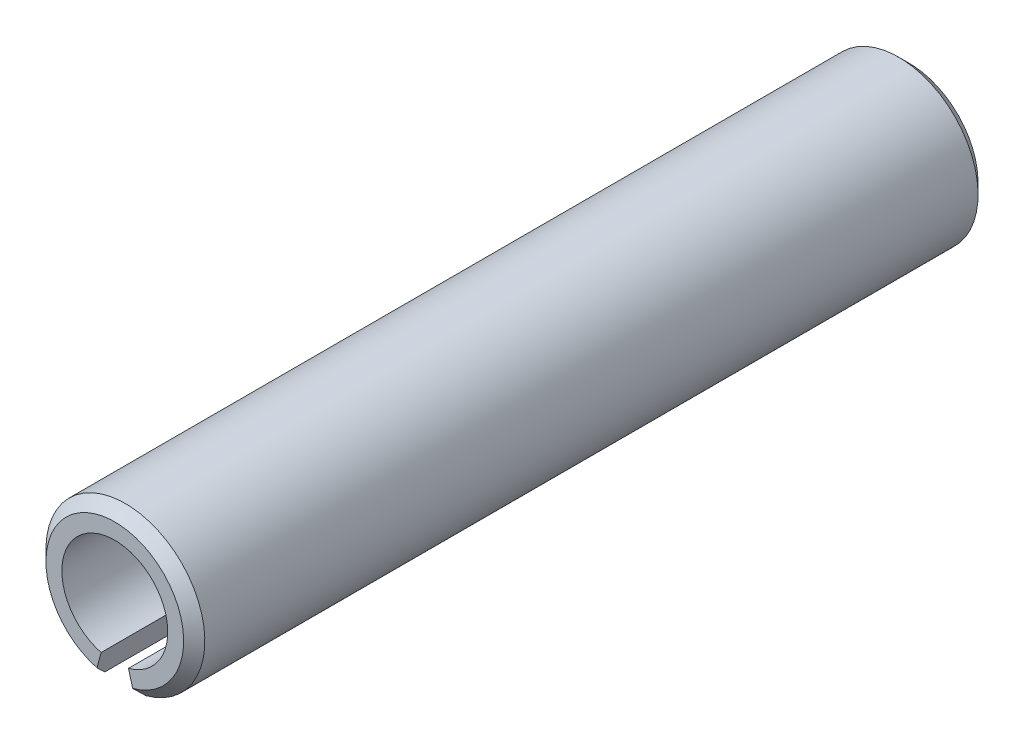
from build123d import *

# Parameters (mm, degrees)
BASE_EXTRUSION_DEPTH = 15
CHANFREIN1_SIZE      = 0.2


with BuildPart() as part:
    # Esquisse1 → Base-Extrusion (new body)
    with BuildSketch(Plane.XY):
        with BuildLine():
            Line((-0.258819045, -0.965925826), (-0.388228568, -1.448888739))
            ThreePointArc((-0.388228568, -1.448888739), (0, 1.5), (0.388228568, -1.448888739))
            Line((0.388228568, -1.448888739), (0.258819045, -0.965925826))
            ThreePointArc((0.258819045, -0.965925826), (0, 1), (-0.258819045, -0.965925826))
        make_face()
    extrude(amount=BASE_EXTRUSION_DEPTH)

    # Chanfrein1
    chanfrein1_edges = [part.edges().sort_by_distance(p)[0] for p in [
        (0, 1.5, 0),
        (0, 1.5, 15),
    ]]
    chamfer(chanfrein1_edges, length=CHANFREIN1_SIZE)


solid = part.part
